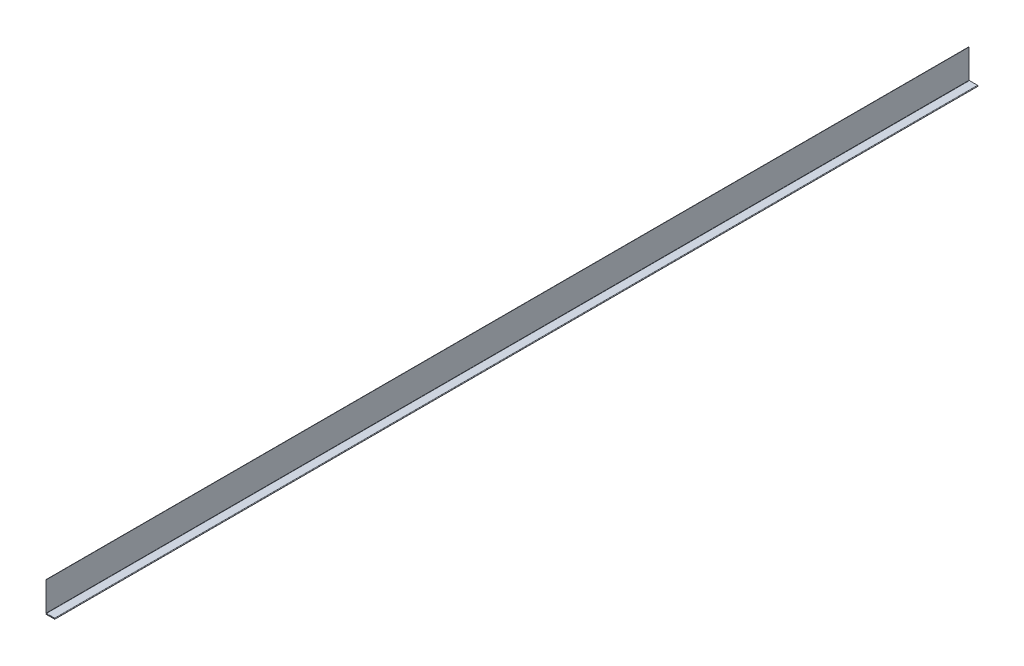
ISO-10303-21;
HEADER;
FILE_DESCRIPTION(('STEP AP214'),'2;1');
FILE_NAME('part.step','',(''),(''),'','','');
FILE_SCHEMA(('AUTOMOTIVE_DESIGN { 1 0 10303 214 1 1 1 1 }'));
ENDSEC;
DATA;
#1=APPLICATION_CONTEXT('core data for automotive mechanical design processes');
#2=APPLICATION_PROTOCOL_DEFINITION('international standard','automotive_design',2000,#1);
#3=PRODUCT_CONTEXT('',#1,'mechanical');
#4=PRODUCT('Part','Part','',(#3));
#5=PRODUCT_RELATED_PRODUCT_CATEGORY('part','',(#4));
#6=PRODUCT_DEFINITION_FORMATION('','',#4);
#7=PRODUCT_DEFINITION_CONTEXT('part definition',#1,'design');
#8=PRODUCT_DEFINITION('design','',#6,#7);
#9=PRODUCT_DEFINITION_SHAPE('','',#8);
#10=(LENGTH_UNIT() NAMED_UNIT(*) SI_UNIT(.MILLI.,.METRE.));
#11=(NAMED_UNIT(*) PLANE_ANGLE_UNIT() SI_UNIT($,.RADIAN.));
#12=(NAMED_UNIT(*) SI_UNIT($,.STERADIAN.) SOLID_ANGLE_UNIT());
#13=UNCERTAINTY_MEASURE_WITH_UNIT(LENGTH_MEASURE(1.E-05),#10,'distance_accuracy_value','');
#14=(GEOMETRIC_REPRESENTATION_CONTEXT(3) GLOBAL_UNCERTAINTY_ASSIGNED_CONTEXT((#13)) GLOBAL_UNIT_ASSIGNED_CONTEXT((#10,
#11,#12)) REPRESENTATION_CONTEXT('',''));
#15=CARTESIAN_POINT('',(0.,0.,0.));
#16=DIRECTION('',(0.,0.,1.));
#17=DIRECTION('',(1.,0.,0.));
#18=AXIS2_PLACEMENT_3D('',#15,#16,#17);
#19=CARTESIAN_POINT('',(18.542,-1.016,2000.));
#20=DIRECTION('',(0.,-1.,0.));
#21=DIRECTION('',(1.,0.,0.));
#22=AXIS2_PLACEMENT_3D('',#19,#20,#21);
#23=PLANE('',#22);
#24=DIRECTION('',(-1.,0.,0.));
#25=VECTOR('',#24,1.);
#26=CARTESIAN_POINT('',(18.542,-1.016,0.));
#27=LINE('',#26,#25);
#28=CARTESIAN_POINT('',(18.542,-1.016,0.));
#29=VERTEX_POINT('',#28);
#30=CARTESIAN_POINT('',(0.,-1.016,0.));
#31=VERTEX_POINT('',#30);
#32=EDGE_CURVE('E165',#29,#31,#27,.T.);
#33=ORIENTED_EDGE('',*,*,#32,.T.);
#34=DIRECTION('',(0.,0.,-1.));
#35=VECTOR('',#34,1.);
#36=CARTESIAN_POINT('',(0.,-1.016,2000.));
#37=LINE('',#36,#35);
#38=CARTESIAN_POINT('',(0.,-1.016,2000.));
#39=VERTEX_POINT('',#38);
#40=EDGE_CURVE('E13',#39,#31,#37,.T.);
#41=ORIENTED_EDGE('',*,*,#40,.F.);
#42=DIRECTION('',(-1.,0.,0.));
#43=VECTOR('',#42,1.);
#44=CARTESIAN_POINT('',(18.542,-1.016,2000.));
#45=LINE('',#44,#43);
#46=CARTESIAN_POINT('',(18.542,-1.016,2000.));
#47=VERTEX_POINT('',#46);
#48=EDGE_CURVE('E113',#47,#39,#45,.T.);
#49=ORIENTED_EDGE('',*,*,#48,.F.);
#50=DIRECTION('',(0.,0.,-1.));
#51=VECTOR('',#50,1.);
#52=CARTESIAN_POINT('',(18.542,-1.016,2000.));
#53=LINE('',#52,#51);
#54=EDGE_CURVE('E161',#47,#29,#53,.T.);
#55=ORIENTED_EDGE('',*,*,#54,.T.);
#56=EDGE_LOOP('',(#33,#41,#49,#55));
#57=FACE_BOUND('',#56,.T.);
#58=ADVANCED_FACE('F45',(#57),#23,.F.);
#59=CARTESIAN_POINT('',(0.,-1.524,2000.));
#60=DIRECTION('',(-1.,0.,0.));
#61=DIRECTION('',(0.,-1.,0.));
#62=AXIS2_PLACEMENT_3D('',#59,#60,#61);
#63=PLANE('',#62);
#64=DIRECTION('',(0.,1.,0.));
#65=VECTOR('',#64,1.);
#66=CARTESIAN_POINT('',(0.,-1.524,0.));
#67=LINE('',#66,#65);
#68=CARTESIAN_POINT('',(0.,-1.524,0.));
#69=VERTEX_POINT('',#68);
#70=EDGE_CURVE('E168',#69,#31,#67,.T.);
#71=ORIENTED_EDGE('',*,*,#70,.F.);
#72=DIRECTION('',(0.,0.,-1.));
#73=VECTOR('',#72,1.);
#74=CARTESIAN_POINT('',(0.,-1.524,2000.));
#75=LINE('',#74,#73);
#76=CARTESIAN_POINT('',(0.,-1.524,2000.));
#77=VERTEX_POINT('',#76);
#78=EDGE_CURVE('E53',#77,#69,#75,.T.);
#79=ORIENTED_EDGE('',*,*,#78,.F.);
#80=DIRECTION('',(0.,1.,0.));
#81=VECTOR('',#80,1.);
#82=CARTESIAN_POINT('',(0.,-1.524,2000.));
#83=LINE('',#82,#81);
#84=EDGE_CURVE('E230',#77,#39,#83,.T.);
#85=ORIENTED_EDGE('',*,*,#84,.T.);
#86=ORIENTED_EDGE('',*,*,#40,.T.);
#87=EDGE_LOOP('',(#71,#79,#85,#86));
#88=FACE_BOUND('',#87,.T.);
#89=ADVANCED_FACE('F217',(#88),#63,.T.);
#90=CARTESIAN_POINT('',(18.542,-1.524,2000.));
#91=DIRECTION('',(0.,-1.,0.));
#92=DIRECTION('',(1.,0.,0.));
#93=AXIS2_PLACEMENT_3D('',#90,#91,#92);
#94=PLANE('',#93);
#95=DIRECTION('',(-1.,0.,0.));
#96=VECTOR('',#95,1.);
#97=CARTESIAN_POINT('',(18.542,-1.524,0.));
#98=LINE('',#97,#96);
#99=CARTESIAN_POINT('',(18.542,-1.524,0.));
#100=VERTEX_POINT('',#99);
#101=EDGE_CURVE('E171',#100,#69,#98,.T.);
#102=ORIENTED_EDGE('',*,*,#101,.F.);
#103=DIRECTION('',(0.,0.,-1.));
#104=VECTOR('',#103,1.);
#105=CARTESIAN_POINT('',(18.542,-1.524,2000.));
#106=LINE('',#105,#104);
#107=CARTESIAN_POINT('',(18.542,-1.524,2000.));
#108=VERTEX_POINT('',#107);
#109=EDGE_CURVE('E207',#108,#100,#106,.T.);
#110=ORIENTED_EDGE('',*,*,#109,.F.);
#111=DIRECTION('',(-1.,0.,0.));
#112=VECTOR('',#111,1.);
#113=CARTESIAN_POINT('',(18.542,-1.524,2000.));
#114=LINE('',#113,#112);
#115=EDGE_CURVE('E214',#108,#77,#114,.T.);
#116=ORIENTED_EDGE('',*,*,#115,.T.);
#117=ORIENTED_EDGE('',*,*,#78,.T.);
#118=EDGE_LOOP('',(#102,#110,#116,#117));
#119=FACE_BOUND('',#118,.T.);
#120=ADVANCED_FACE('F212',(#119),#94,.T.);
#121=CARTESIAN_POINT('',(18.542,-0.508,2000.));
#122=DIRECTION('',(0.,0.,-1.));
#123=DIRECTION('',(-1.,0.,0.));
#124=AXIS2_PLACEMENT_3D('',#121,#122,#123);
#125=CYLINDRICAL_SURFACE('',#124,1.016);
#126=CARTESIAN_POINT('',(18.542,-0.508,0.));
#127=DIRECTION('',(0.,0.,1.));
#128=DIRECTION('',(1.,0.,0.));
#129=AXIS2_PLACEMENT_3D('',#126,#127,#128);
#130=CIRCLE('',#129,1.016);
#131=CARTESIAN_POINT('',(18.542,0.508,0.));
#132=VERTEX_POINT('',#131);
#133=EDGE_CURVE('E174',#132,#100,#130,.F.);
#134=ORIENTED_EDGE('',*,*,#133,.F.);
#135=DIRECTION('',(0.,0.,-1.));
#136=VECTOR('',#135,1.);
#137=CARTESIAN_POINT('',(18.542,0.508,2000.));
#138=LINE('',#137,#136);
#139=CARTESIAN_POINT('',(18.542,0.508,2000.));
#140=VERTEX_POINT('',#139);
#141=EDGE_CURVE('E205',#140,#132,#138,.T.);
#142=ORIENTED_EDGE('',*,*,#141,.F.);
#143=CARTESIAN_POINT('',(18.542,-0.508,2000.));
#144=DIRECTION('',(0.,0.,1.));
#145=DIRECTION('',(1.,0.,0.));
#146=AXIS2_PLACEMENT_3D('',#143,#144,#145);
#147=CIRCLE('',#146,1.016);
#148=EDGE_CURVE('E227',#140,#108,#147,.F.);
#149=ORIENTED_EDGE('',*,*,#148,.T.);
#150=ORIENTED_EDGE('',*,*,#109,.T.);
#151=EDGE_LOOP('',(#134,#142,#149,#150));
#152=FACE_BOUND('',#151,.T.);
#153=ADVANCED_FACE('F224',(#152),#125,.T.);
#154=CARTESIAN_POINT('',(1.,0.508,2000.));
#155=DIRECTION('',(0.,1.,0.));
#156=DIRECTION('',(0.,0.,1.));
#157=AXIS2_PLACEMENT_3D('',#154,#155,#156);
#158=PLANE('',#157);
#159=DIRECTION('',(1.,0.,0.));
#160=VECTOR('',#159,1.);
#161=CARTESIAN_POINT('',(1.,0.508,0.));
#162=LINE('',#161,#160);
#163=CARTESIAN_POINT('',(1.,0.508,0.));
#164=VERTEX_POINT('',#163);
#165=EDGE_CURVE('E177',#164,#132,#162,.T.);
#166=ORIENTED_EDGE('',*,*,#165,.F.);
#167=DIRECTION('',(0.,0.,-1.));
#168=VECTOR('',#167,1.);
#169=CARTESIAN_POINT('',(1.,0.508,2000.));
#170=LINE('',#169,#168);
#171=CARTESIAN_POINT('',(1.,0.508,2000.));
#172=VERTEX_POINT('',#171);
#173=EDGE_CURVE('E203',#172,#164,#170,.T.);
#174=ORIENTED_EDGE('',*,*,#173,.F.);
#175=DIRECTION('',(1.,0.,0.));
#176=VECTOR('',#175,1.);
#177=CARTESIAN_POINT('',(1.,0.508,2000.));
#178=LINE('',#177,#176);
#179=EDGE_CURVE('E232',#172,#140,#178,.T.);
#180=ORIENTED_EDGE('',*,*,#179,.T.);
#181=ORIENTED_EDGE('',*,*,#141,.T.);
#182=EDGE_LOOP('',(#166,#174,#180,#181));
#183=FACE_BOUND('',#182,.T.);
#184=ADVANCED_FACE('F332',(#183),#158,.T.);
#185=CARTESIAN_POINT('',(1.,1.,2000.));
#186=DIRECTION('',(0.,0.,-1.));
#187=DIRECTION('',(-1.,0.,0.));
#188=AXIS2_PLACEMENT_3D('',#185,#186,#187);
#189=CYLINDRICAL_SURFACE('',#188,0.492);
#190=CARTESIAN_POINT('',(1.,1.,0.));
#191=DIRECTION('',(0.,0.,1.));
#192=DIRECTION('',(1.,0.,0.));
#193=AXIS2_PLACEMENT_3D('',#190,#191,#192);
#194=CIRCLE('',#193,0.492);
#195=CARTESIAN_POINT('',(0.508,1.,0.));
#196=VERTEX_POINT('',#195);
#197=EDGE_CURVE('E180',#196,#164,#194,.T.);
#198=ORIENTED_EDGE('',*,*,#197,.F.);
#199=DIRECTION('',(0.,0.,-1.));
#200=VECTOR('',#199,1.);
#201=CARTESIAN_POINT('',(0.508,1.,2000.));
#202=LINE('',#201,#200);
#203=CARTESIAN_POINT('',(0.508,1.,2000.));
#204=VERTEX_POINT('',#203);
#205=EDGE_CURVE('E201',#204,#196,#202,.T.);
#206=ORIENTED_EDGE('',*,*,#205,.F.);
#207=CARTESIAN_POINT('',(1.,1.,2000.));
#208=DIRECTION('',(0.,0.,1.));
#209=DIRECTION('',(1.,0.,0.));
#210=AXIS2_PLACEMENT_3D('',#207,#208,#209);
#211=CIRCLE('',#210,0.492);
#212=EDGE_CURVE('E238',#204,#172,#211,.T.);
#213=ORIENTED_EDGE('',*,*,#212,.T.);
#214=ORIENTED_EDGE('',*,*,#173,.T.);
#215=EDGE_LOOP('',(#198,#206,#213,#214));
#216=FACE_BOUND('',#215,.T.);
#217=ADVANCED_FACE('F323',(#216),#189,.F.);
#218=CARTESIAN_POINT('',(0.508,1.,2000.));
#219=DIRECTION('',(1.,0.,0.));
#220=DIRECTION('',(0.,0.,-1.));
#221=AXIS2_PLACEMENT_3D('',#218,#219,#220);
#222=PLANE('',#221);
#223=DIRECTION('',(0.,1.,0.));
#224=VECTOR('',#223,1.);
#225=CARTESIAN_POINT('',(0.508,1.,0.));
#226=LINE('',#225,#224);
#227=CARTESIAN_POINT('',(0.508,63.5,0.));
#228=VERTEX_POINT('',#227);
#229=EDGE_CURVE('E183',#228,#196,#226,.F.);
#230=ORIENTED_EDGE('',*,*,#229,.F.);
#231=DIRECTION('',(0.,0.,-1.));
#232=VECTOR('',#231,1.);
#233=CARTESIAN_POINT('',(0.508,63.5,2000.));
#234=LINE('',#233,#232);
#235=CARTESIAN_POINT('',(0.508,63.5,2000.));
#236=VERTEX_POINT('',#235);
#237=EDGE_CURVE('E199',#236,#228,#234,.T.);
#238=ORIENTED_EDGE('',*,*,#237,.F.);
#239=DIRECTION('',(0.,1.,0.));
#240=VECTOR('',#239,1.);
#241=CARTESIAN_POINT('',(0.508,1.,2000.));
#242=LINE('',#241,#240);
#243=EDGE_CURVE('E241',#236,#204,#242,.F.);
#244=ORIENTED_EDGE('',*,*,#243,.T.);
#245=ORIENTED_EDGE('',*,*,#205,.T.);
#246=EDGE_LOOP('',(#230,#238,#244,#245));
#247=FACE_BOUND('',#246,.T.);
#248=ADVANCED_FACE('F253',(#247),#222,.T.);
#249=CARTESIAN_POINT('',(0.,63.5,2000.));
#250=DIRECTION('',(0.,1.,0.));
#251=DIRECTION('',(0.,0.,1.));
#252=AXIS2_PLACEMENT_3D('',#249,#250,#251);
#253=PLANE('',#252);
#254=DIRECTION('',(1.,0.,0.));
#255=VECTOR('',#254,1.);
#256=CARTESIAN_POINT('',(0.,63.5,0.));
#257=LINE('',#256,#255);
#258=CARTESIAN_POINT('',(0.,63.5,0.));
#259=VERTEX_POINT('',#258);
#260=EDGE_CURVE('E186',#259,#228,#257,.T.);
#261=ORIENTED_EDGE('',*,*,#260,.F.);
#262=DIRECTION('',(0.,0.,-1.));
#263=VECTOR('',#262,1.);
#264=CARTESIAN_POINT('',(0.,63.5,2000.));
#265=LINE('',#264,#263);
#266=CARTESIAN_POINT('',(0.,63.5,2000.));
#267=VERTEX_POINT('',#266);
#268=EDGE_CURVE('E197',#267,#259,#265,.T.);
#269=ORIENTED_EDGE('',*,*,#268,.F.);
#270=DIRECTION('',(1.,0.,0.));
#271=VECTOR('',#270,1.);
#272=CARTESIAN_POINT('',(0.,63.5,2000.));
#273=LINE('',#272,#271);
#274=EDGE_CURVE('E244',#267,#236,#273,.T.);
#275=ORIENTED_EDGE('',*,*,#274,.T.);
#276=ORIENTED_EDGE('',*,*,#237,.T.);
#277=EDGE_LOOP('',(#261,#269,#275,#276));
#278=FACE_BOUND('',#277,.T.);
#279=ADVANCED_FACE('F248',(#278),#253,.T.);
#280=CARTESIAN_POINT('',(0.,1.,2000.));
#281=DIRECTION('',(1.,0.,0.));
#282=DIRECTION('',(0.,0.,-1.));
#283=AXIS2_PLACEMENT_3D('',#280,#281,#282);
#284=PLANE('',#283);
#285=DIRECTION('',(0.,-1.,0.));
#286=VECTOR('',#285,1.);
#287=CARTESIAN_POINT('',(0.,1.,0.));
#288=LINE('',#287,#286);
#289=CARTESIAN_POINT('',(0.,1.,0.));
#290=VERTEX_POINT('',#289);
#291=EDGE_CURVE('E189',#259,#290,#288,.T.);
#292=ORIENTED_EDGE('',*,*,#291,.T.);
#293=DIRECTION('',(0.,0.,-1.));
#294=VECTOR('',#293,1.);
#295=CARTESIAN_POINT('',(0.,1.,2000.));
#296=LINE('',#295,#294);
#297=CARTESIAN_POINT('',(0.,1.,2000.));
#298=VERTEX_POINT('',#297);
#299=EDGE_CURVE('E156',#298,#290,#296,.T.);
#300=ORIENTED_EDGE('',*,*,#299,.F.);
#301=DIRECTION('',(0.,-1.,0.));
#302=VECTOR('',#301,1.);
#303=CARTESIAN_POINT('',(0.,1.,2000.));
#304=LINE('',#303,#302);
#305=EDGE_CURVE('E147',#267,#298,#304,.T.);
#306=ORIENTED_EDGE('',*,*,#305,.F.);
#307=ORIENTED_EDGE('',*,*,#268,.T.);
#308=EDGE_LOOP('',(#292,#300,#306,#307));
#309=FACE_BOUND('',#308,.T.);
#310=ADVANCED_FACE('F257',(#309),#284,.F.);
#311=CARTESIAN_POINT('',(1.,1.,2000.));
#312=DIRECTION('',(0.,0.,-1.));
#313=DIRECTION('',(-1.,0.,0.));
#314=AXIS2_PLACEMENT_3D('',#311,#312,#313);
#315=CYLINDRICAL_SURFACE('',#314,1.);
#316=CARTESIAN_POINT('',(1.,1.,0.));
#317=DIRECTION('',(0.,0.,1.));
#318=DIRECTION('',(1.,0.,0.));
#319=AXIS2_PLACEMENT_3D('',#316,#317,#318);
#320=CIRCLE('',#319,1.);
#321=CARTESIAN_POINT('',(1.,0.,0.));
#322=VERTEX_POINT('',#321);
#323=EDGE_CURVE('E155',#290,#322,#320,.T.);
#324=ORIENTED_EDGE('',*,*,#323,.T.);
#325=DIRECTION('',(0.,0.,-1.));
#326=VECTOR('',#325,1.);
#327=CARTESIAN_POINT('',(1.,0.,2000.));
#328=LINE('',#327,#326);
#329=CARTESIAN_POINT('',(1.,0.,2000.));
#330=VERTEX_POINT('',#329);
#331=EDGE_CURVE('E152',#330,#322,#328,.T.);
#332=ORIENTED_EDGE('',*,*,#331,.F.);
#333=CARTESIAN_POINT('',(1.,1.,2000.));
#334=DIRECTION('',(0.,0.,1.));
#335=DIRECTION('',(1.,0.,0.));
#336=AXIS2_PLACEMENT_3D('',#333,#334,#335);
#337=CIRCLE('',#336,1.);
#338=EDGE_CURVE('E140',#298,#330,#337,.T.);
#339=ORIENTED_EDGE('',*,*,#338,.F.);
#340=ORIENTED_EDGE('',*,*,#299,.T.);
#341=EDGE_LOOP('',(#324,#332,#339,#340));
#342=FACE_BOUND('',#341,.T.);
#343=ADVANCED_FACE('F153',(#342),#315,.T.);
#344=CARTESIAN_POINT('',(1.,0.,2000.));
#345=DIRECTION('',(0.,1.,0.));
#346=DIRECTION('',(0.,0.,1.));
#347=AXIS2_PLACEMENT_3D('',#344,#345,#346);
#348=PLANE('',#347);
#349=DIRECTION('',(1.,0.,0.));
#350=VECTOR('',#349,1.);
#351=CARTESIAN_POINT('',(1.,0.,0.));
#352=LINE('',#351,#350);
#353=CARTESIAN_POINT('',(18.542,0.,0.));
#354=VERTEX_POINT('',#353);
#355=EDGE_CURVE('E101',#322,#354,#352,.T.);
#356=ORIENTED_EDGE('',*,*,#355,.T.);
#357=DIRECTION('',(0.,0.,-1.));
#358=VECTOR('',#357,1.);
#359=CARTESIAN_POINT('',(18.542,0.,2000.));
#360=LINE('',#359,#358);
#361=CARTESIAN_POINT('',(18.542,0.,2000.));
#362=VERTEX_POINT('',#361);
#363=EDGE_CURVE('E157',#362,#354,#360,.T.);
#364=ORIENTED_EDGE('',*,*,#363,.F.);
#365=DIRECTION('',(1.,0.,0.));
#366=VECTOR('',#365,1.);
#367=CARTESIAN_POINT('',(1.,0.,2000.));
#368=LINE('',#367,#366);
#369=EDGE_CURVE('E144',#330,#362,#368,.T.);
#370=ORIENTED_EDGE('',*,*,#369,.F.);
#371=ORIENTED_EDGE('',*,*,#331,.T.);
#372=EDGE_LOOP('',(#356,#364,#370,#371));
#373=FACE_BOUND('',#372,.T.);
#374=ADVANCED_FACE('F159',(#373),#348,.F.);
#375=CARTESIAN_POINT('',(18.542,-0.508,2000.));
#376=DIRECTION('',(0.,0.,-1.));
#377=DIRECTION('',(-1.,0.,0.));
#378=AXIS2_PLACEMENT_3D('',#375,#376,#377);
#379=CYLINDRICAL_SURFACE('',#378,0.508);
#380=CARTESIAN_POINT('',(18.542,-0.508,0.));
#381=DIRECTION('',(0.,0.,-1.));
#382=DIRECTION('',(1.,0.,0.));
#383=AXIS2_PLACEMENT_3D('',#380,#381,#382);
#384=CIRCLE('',#383,0.508);
#385=EDGE_CURVE('E107',#354,#29,#384,.T.);
#386=ORIENTED_EDGE('',*,*,#385,.T.);
#387=ORIENTED_EDGE('',*,*,#54,.F.);
#388=CARTESIAN_POINT('',(18.542,-0.508,2000.));
#389=DIRECTION('',(0.,0.,-1.));
#390=DIRECTION('',(1.,0.,0.));
#391=AXIS2_PLACEMENT_3D('',#388,#389,#390);
#392=CIRCLE('',#391,0.508);
#393=EDGE_CURVE('E61',#362,#47,#392,.T.);
#394=ORIENTED_EDGE('',*,*,#393,.F.);
#395=ORIENTED_EDGE('',*,*,#363,.T.);
#396=EDGE_LOOP('',(#386,#387,#394,#395));
#397=FACE_BOUND('',#396,.T.);
#398=ADVANCED_FACE('F271',(#397),#379,.F.);
#399=CARTESIAN_POINT('',(18.542,-0.508,2000.));
#400=DIRECTION('',(0.,0.,1.));
#401=DIRECTION('',(1.,0.,0.));
#402=AXIS2_PLACEMENT_3D('',#399,#400,#401);
#403=PLANE('',#402);
#404=ORIENTED_EDGE('',*,*,#48,.T.);
#405=ORIENTED_EDGE('',*,*,#84,.F.);
#406=ORIENTED_EDGE('',*,*,#115,.F.);
#407=ORIENTED_EDGE('',*,*,#148,.F.);
#408=ORIENTED_EDGE('',*,*,#179,.F.);
#409=ORIENTED_EDGE('',*,*,#212,.F.);
#410=ORIENTED_EDGE('',*,*,#243,.F.);
#411=ORIENTED_EDGE('',*,*,#274,.F.);
#412=ORIENTED_EDGE('',*,*,#305,.T.);
#413=ORIENTED_EDGE('',*,*,#338,.T.);
#414=ORIENTED_EDGE('',*,*,#369,.T.);
#415=ORIENTED_EDGE('',*,*,#393,.T.);
#416=EDGE_LOOP('',(#404,#405,#406,#407,#408,#409,#410,#411,#412,#413,#414,#415));
#417=FACE_BOUND('',#416,.T.);
#418=ADVANCED_FACE('F142',(#417),#403,.T.);
#419=CARTESIAN_POINT('',(18.542,-0.508,0.));
#420=DIRECTION('',(0.,0.,1.));
#421=DIRECTION('',(1.,0.,0.));
#422=AXIS2_PLACEMENT_3D('',#419,#420,#421);
#423=PLANE('',#422);
#424=ORIENTED_EDGE('',*,*,#32,.F.);
#425=ORIENTED_EDGE('',*,*,#385,.F.);
#426=ORIENTED_EDGE('',*,*,#355,.F.);
#427=ORIENTED_EDGE('',*,*,#323,.F.);
#428=ORIENTED_EDGE('',*,*,#291,.F.);
#429=ORIENTED_EDGE('',*,*,#260,.T.);
#430=ORIENTED_EDGE('',*,*,#229,.T.);
#431=ORIENTED_EDGE('',*,*,#197,.T.);
#432=ORIENTED_EDGE('',*,*,#165,.T.);
#433=ORIENTED_EDGE('',*,*,#133,.T.);
#434=ORIENTED_EDGE('',*,*,#101,.T.);
#435=ORIENTED_EDGE('',*,*,#70,.T.);
#436=EDGE_LOOP('',(#424,#425,#426,#427,#428,#429,#430,#431,#432,#433,#434,#435));
#437=FACE_BOUND('',#436,.T.);
#438=ADVANCED_FACE('F220',(#437),#423,.F.);
#439=CLOSED_SHELL('',(#58,#89,#120,#153,#184,#217,#248,#279,#310,#343,#374,#398,#418,#438));
#440=MANIFOLD_SOLID_BREP('B2',#439);
#441=ADVANCED_BREP_SHAPE_REPRESENTATION('',(#18,#440),#14);
#442=SHAPE_DEFINITION_REPRESENTATION(#9,#441);
ENDSEC;
END-ISO-10303-21;
